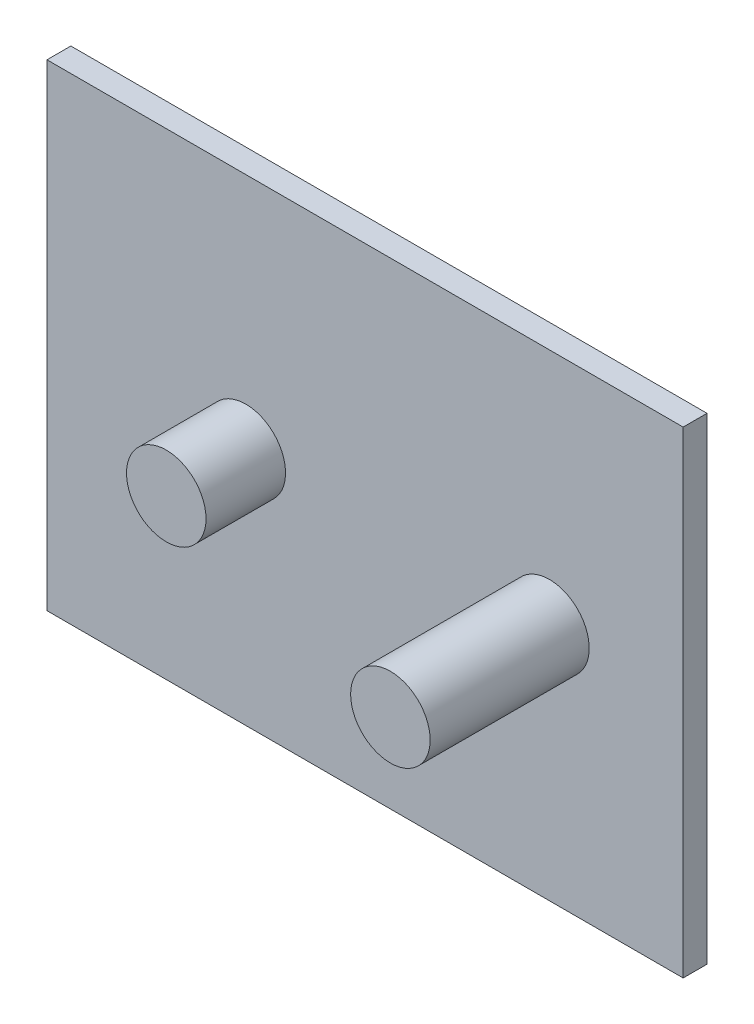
from build123d import *

# Parameters (mm, degrees)
ESQUISSE1_W                = 80
ESQUISSE1_H                = 60
EXTRUSION1_DEPTH           = 3
ESQUISSE2_R                = 5
EXTRUSION2_DEPTH           = 10
R_P_TITION_LIN_AIRE1_COUNT = 2
R_P_TITION_LIN_AIRE1_PITCH = 38.183766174
ESQUISSE4_R                = 5
EXTRUSION3_DEPTH           = 10


with BuildPart() as part:
    # Esquisse1 → Extrusion1 (new body)
    with BuildSketch(Plane.XY):
        with Locations((40, 30)):
            Rectangle(ESQUISSE1_W, ESQUISSE1_H)
    extrude(amount=EXTRUSION1_DEPTH)

    # Esquisse2 → Extrusion2 (add)
    with BuildSketch(Plane.XY.offset(3)):
        with Locations(Location((25, 30, 0), (0, 0, 180))):
            Circle(ESQUISSE2_R)
    extrusion2 = extrude(amount=EXTRUSION2_DEPTH)

    # R_p_tition lin_aire1: Extrusion2 ×2
    with Locations(*[(i * R_P_TITION_LIN_AIRE1_PITCH, 0, 0) for i in range(1, R_P_TITION_LIN_AIRE1_COUNT)]):
        add(extrusion2)

    # Esquisse4 → Extrusion3 (add)
    with BuildSketch(Plane.XY.offset(13)):
        with Locations(Location((63.183766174, 30, 0), (0, 0, 180))):
            Circle(ESQUISSE4_R)
    extrude(amount=EXTRUSION3_DEPTH)


solid = part.part
